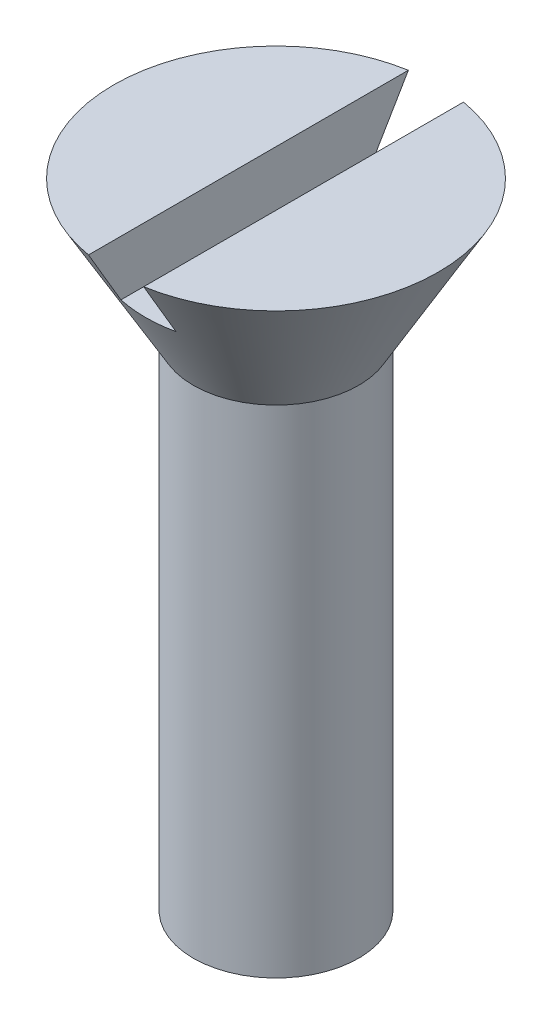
from build123d import *

# Parameters (mm, degrees)
SKETCH2_W          = 2
SKETCH2_H          = 2
CUT_EXTRUDE2_DEPTH = 6


with BuildPart() as part:
    # Sketch1 → Revolve1 (revolve)
    with BuildSketch(Plane.XY, mode=Mode.PRIVATE) as revolve1_sk:
        Polygon((0, 0), (0, 24.732050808), (5.886751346, 24.732050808), (3, 19.732050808), (3, 1.732050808), align=None)
    revolve(revolve1_sk.sketch.rotate(Axis((0, 30.123486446, 0), (0, -1, 0)), 90), axis=Axis((0, 30.123486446, 0), (0, -1, 0)))

    # Sketch2 → Cut-Extrude2 (cut, symmetric)
    with BuildSketch(Plane.XY):
        with Locations((0, 23.732050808)):
            Rectangle(SKETCH2_W, SKETCH2_H)
    extrude(amount=CUT_EXTRUDE2_DEPTH, both=True, mode=Mode.SUBTRACT)


solid = part.part
